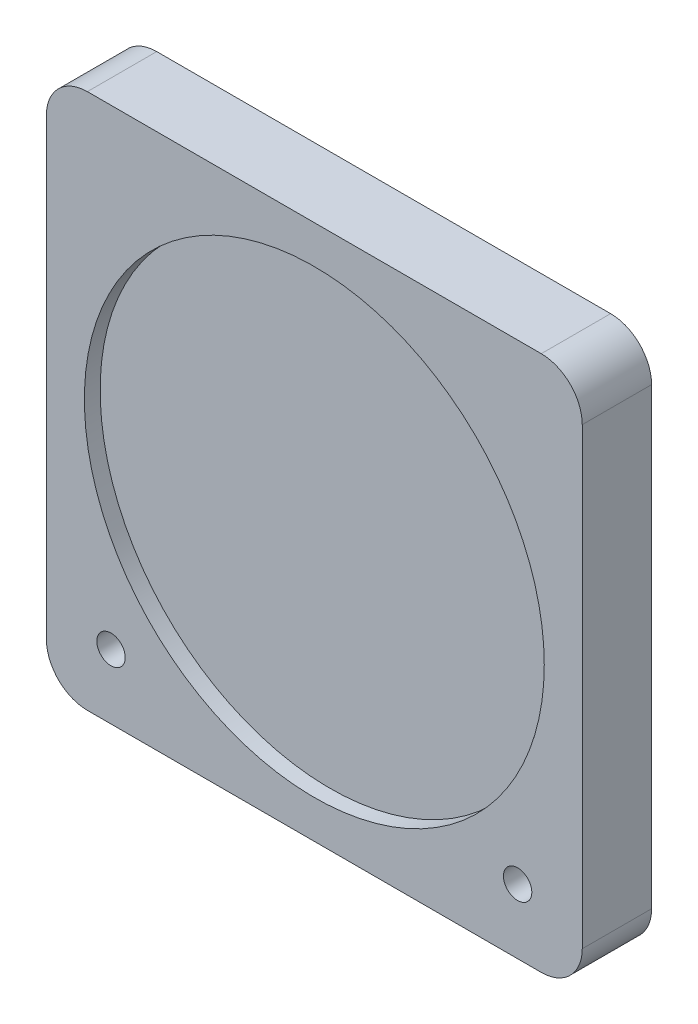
from build123d import *

# Parameters (mm, degrees)
ESQUISSE1_W                = 170
ESQUISSE1_H                = 170
EXTRUSION1_DEPTH           = 22
CONG_1_R                   = 13
D_GAGEMENT_M81_D           = 9
R_P_TITION_LIN_AIRE1_COUNT = 2
R_P_TITION_LIN_AIRE1_PITCH = 129
ESQUISSE4_R                = 72.95
ENL_V_MAT_EXTRU_1_DEPTH    = 5


with BuildPart() as part:
    # Esquisse1 → Extrusion1 (new body)
    with BuildSketch(Plane.XY):
        with Locations((85, 85)):
            Rectangle(ESQUISSE1_W, ESQUISSE1_H)
    extrude(amount=EXTRUSION1_DEPTH)

    # Cong_1
    cong_1_edges = [part.edges().sort_by_distance(p)[0] for p in [
        (0, 170, 11),
        (170, 170, 11),
        (170, 0, 11),
        (0, 0, 11),
    ]]
    fillet(cong_1_edges, radius=CONG_1_R)

    # D_gagement M81 (through all)
    with Locations(Plane.XY.offset(22)):
        with Locations((149.5, 20.5)):
            d_gagement_m81 = Hole(D_GAGEMENT_M81_D / 2)

    # R_p_tition lin_aire1: D_gagement M81 ×2
    with Locations(*[(-i * R_P_TITION_LIN_AIRE1_PITCH, 0, 0) for i in range(1, R_P_TITION_LIN_AIRE1_COUNT)]):
        add(d_gagement_m81, mode=Mode.SUBTRACT)

    # Esquisse4 → Enl_v. mat.-Extru.1 (cut)
    with BuildSketch(Plane.XY.offset(22)):
        with Locations((85, 85)):
            Circle(ESQUISSE4_R)
    extrude(amount=-ENL_V_MAT_EXTRU_1_DEPTH, mode=Mode.SUBTRACT)


solid = part.part
